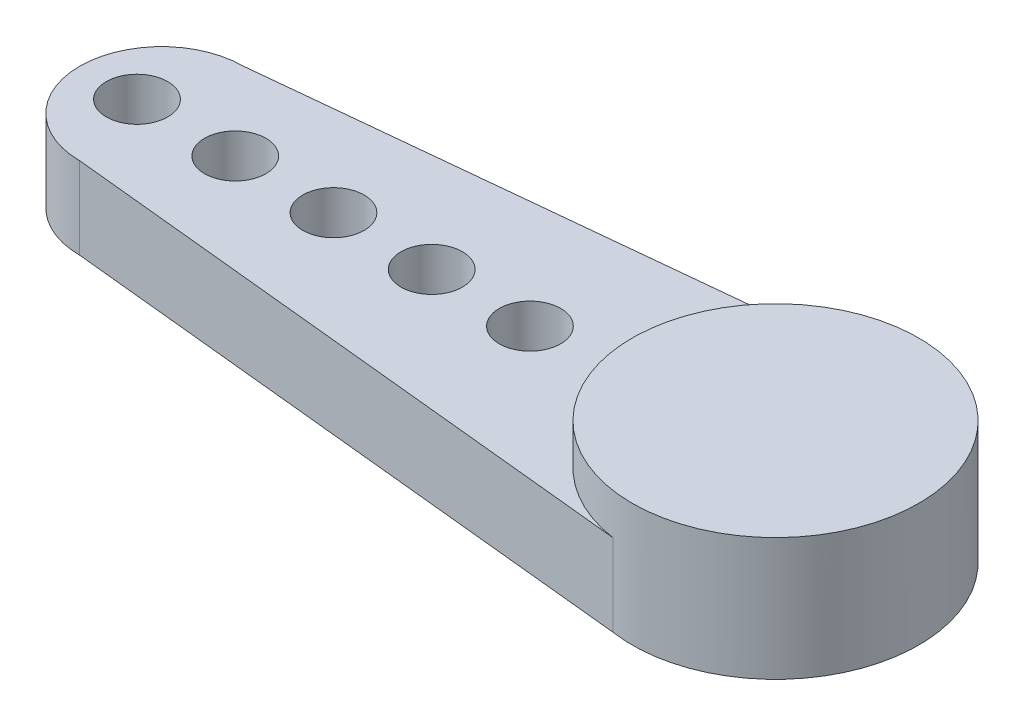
from build123d import *

# Parameters (mm, degrees)
SKETCH1_R           = 0.75
BOSS_EXTRUDE1_DEPTH = 2
SKETCH2_R           = 3.5
BOSS_EXTRUDE2_DEPTH = 1


with BuildPart() as part:
    # Sketch1 → Boss-Extrude1 (new body)
    with BuildSketch(Plane(origin=(0, 0, 0), x_dir=(1, 0, 0), z_dir=(0, 1, 0))):
        with BuildLine():
            Line((-15, 2), (-0.508869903, 3.462809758))
            ThreePointArc((-0.508869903, 3.462809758), (3.5, 0), (-0.508869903, -3.462809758))
            Line((-0.508869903, -3.462809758), (-15, -2))
            ThreePointArc((-15, -2), (-17, 0), (-15, 2))
        make_face()
        with Locations(Location((-6, 0, 0), (0, 0, 270))):
            Circle(SKETCH1_R, mode=Mode.SUBTRACT)
        with Locations(Location((-8.4, 0, 0), (0, 0, 270))):
            Circle(SKETCH1_R, mode=Mode.SUBTRACT)
        with Locations(Location((-10.8, 0, 0), (0, 0, 270))):
            Circle(SKETCH1_R, mode=Mode.SUBTRACT)
        with Locations(Location((-13.2, 0, 0), (0, 0, 270))):
            Circle(SKETCH1_R, mode=Mode.SUBTRACT)
        with Locations(Location((-15.6, 0, 0), (0, 0, 270))):
            Circle(SKETCH1_R, mode=Mode.SUBTRACT)
    extrude(amount=BOSS_EXTRUDE1_DEPTH)

    # Sketch2 → Boss-Extrude2 (add)
    with BuildSketch(Plane(origin=(0, 2, 0), x_dir=(1, 0, 0), z_dir=(0, 1, 0))):
        with Locations(Location((0, 0, 0), (0, 0, 98.359944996))):
            Circle(SKETCH2_R)
    extrude(amount=BOSS_EXTRUDE2_DEPTH)


solid = part.part
